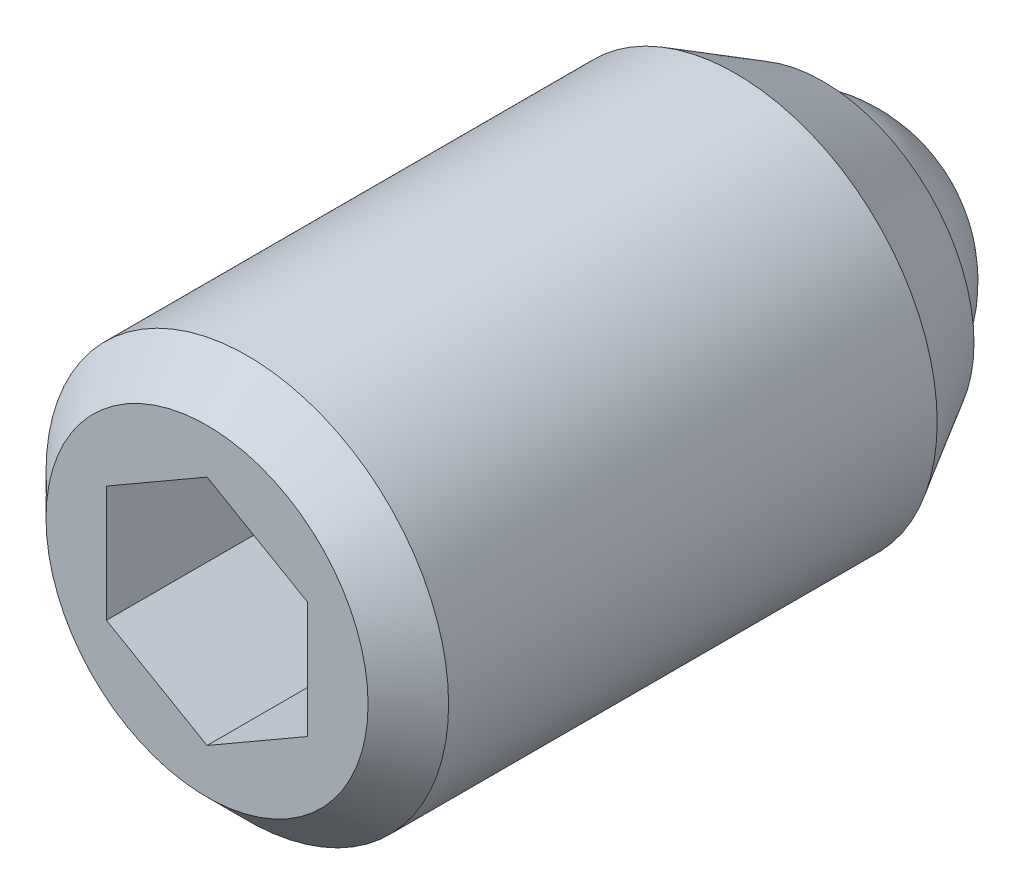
ISO-10303-21;
HEADER;
FILE_DESCRIPTION(('STEP AP214'),'2;1');
FILE_NAME('part.step','',(''),(''),'','','');
FILE_SCHEMA(('AUTOMOTIVE_DESIGN { 1 0 10303 214 1 1 1 1 }'));
ENDSEC;
DATA;
#1=APPLICATION_CONTEXT('core data for automotive mechanical design processes');
#2=APPLICATION_PROTOCOL_DEFINITION('international standard','automotive_design',2000,#1);
#3=PRODUCT_CONTEXT('',#1,'mechanical');
#4=PRODUCT('Part','Part','',(#3));
#5=PRODUCT_RELATED_PRODUCT_CATEGORY('part','',(#4));
#6=PRODUCT_DEFINITION_FORMATION('','',#4);
#7=PRODUCT_DEFINITION_CONTEXT('part definition',#1,'design');
#8=PRODUCT_DEFINITION('design','',#6,#7);
#9=PRODUCT_DEFINITION_SHAPE('','',#8);
#10=(LENGTH_UNIT() NAMED_UNIT(*) SI_UNIT(.MILLI.,.METRE.));
#11=(NAMED_UNIT(*) PLANE_ANGLE_UNIT() SI_UNIT($,.RADIAN.));
#12=(NAMED_UNIT(*) SI_UNIT($,.STERADIAN.) SOLID_ANGLE_UNIT());
#13=UNCERTAINTY_MEASURE_WITH_UNIT(LENGTH_MEASURE(1.E-05),#10,'distance_accuracy_value','');
#14=(GEOMETRIC_REPRESENTATION_CONTEXT(3) GLOBAL_UNCERTAINTY_ASSIGNED_CONTEXT((#13)) GLOBAL_UNIT_ASSIGNED_CONTEXT((#10,
#11,#12)) REPRESENTATION_CONTEXT('',''));
#15=CARTESIAN_POINT('',(0.,0.,0.));
#16=DIRECTION('',(0.,0.,1.));
#17=DIRECTION('',(1.,0.,0.));
#18=AXIS2_PLACEMENT_3D('',#15,#16,#17);
#19=CARTESIAN_POINT('',(2.5,1.44337567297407,15.2));
#20=DIRECTION('',(0.5,0.86602540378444,0.));
#21=DIRECTION('',(0.86602540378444,-0.5,0.));
#22=AXIS2_PLACEMENT_3D('',#19,#20,#21);
#23=PLANE('',#22);
#24=DIRECTION('',(0.,0.,1.));
#25=VECTOR('',#24,1.);
#26=CARTESIAN_POINT('',(2.5,1.44337567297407,15.2));
#27=LINE('',#26,#25);
#28=CARTESIAN_POINT('',(2.5,1.44337567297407,13.7));
#29=VERTEX_POINT('',#28);
#30=CARTESIAN_POINT('',(2.5,1.44337567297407,17.7));
#31=VERTEX_POINT('',#30);
#32=EDGE_CURVE('E68',#29,#31,#27,.T.);
#33=ORIENTED_EDGE('',*,*,#32,.T.);
#34=DIRECTION('',(-0.86602540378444,0.5,0.));
#35=VECTOR('',#34,1.);
#36=CARTESIAN_POINT('',(2.5,1.44337567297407,17.7));
#37=LINE('',#36,#35);
#38=CARTESIAN_POINT('',(0.,2.88675134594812,17.7));
#39=VERTEX_POINT('',#38);
#40=EDGE_CURVE('E29',#31,#39,#37,.T.);
#41=ORIENTED_EDGE('',*,*,#40,.T.);
#42=DIRECTION('',(0.,0.,1.));
#43=VECTOR('',#42,1.);
#44=CARTESIAN_POINT('',(0.,2.88675134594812,15.2));
#45=LINE('',#44,#43);
#46=CARTESIAN_POINT('',(0.,2.88675134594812,13.7));
#47=VERTEX_POINT('',#46);
#48=EDGE_CURVE('E80',#47,#39,#45,.T.);
#49=ORIENTED_EDGE('',*,*,#48,.F.);
#50=DIRECTION('',(-0.86602540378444,0.5,0.));
#51=VECTOR('',#50,1.);
#52=CARTESIAN_POINT('',(2.5,1.44337567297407,13.7));
#53=LINE('',#52,#51);
#54=EDGE_CURVE('E79',#29,#47,#53,.T.);
#55=ORIENTED_EDGE('',*,*,#54,.F.);
#56=EDGE_LOOP('',(#33,#41,#49,#55));
#57=FACE_BOUND('',#56,.T.);
#58=ADVANCED_FACE('F14',(#57),#23,.F.);
#59=CARTESIAN_POINT('',(2.5,-1.44337567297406,15.2));
#60=DIRECTION('',(1.,0.,0.));
#61=DIRECTION('',(0.,-1.,0.));
#62=AXIS2_PLACEMENT_3D('',#59,#60,#61);
#63=PLANE('',#62);
#64=DIRECTION('',(0.,0.,1.));
#65=VECTOR('',#64,1.);
#66=CARTESIAN_POINT('',(2.5,-1.44337567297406,15.2));
#67=LINE('',#66,#65);
#68=CARTESIAN_POINT('',(2.5,-1.44337567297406,13.7));
#69=VERTEX_POINT('',#68);
#70=CARTESIAN_POINT('',(2.5,-1.44337567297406,17.7));
#71=VERTEX_POINT('',#70);
#72=EDGE_CURVE('E76',#69,#71,#67,.T.);
#73=ORIENTED_EDGE('',*,*,#72,.T.);
#74=DIRECTION('',(0.,1.,0.));
#75=VECTOR('',#74,1.);
#76=CARTESIAN_POINT('',(2.5,-1.44337567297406,17.7));
#77=LINE('',#76,#75);
#78=EDGE_CURVE('E75',#71,#31,#77,.T.);
#79=ORIENTED_EDGE('',*,*,#78,.T.);
#80=ORIENTED_EDGE('',*,*,#32,.F.);
#81=DIRECTION('',(0.,1.,0.));
#82=VECTOR('',#81,1.);
#83=CARTESIAN_POINT('',(2.5,-1.44337567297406,13.7));
#84=LINE('',#83,#82);
#85=EDGE_CURVE('E72',#69,#29,#84,.T.);
#86=ORIENTED_EDGE('',*,*,#85,.F.);
#87=EDGE_LOOP('',(#73,#79,#80,#86));
#88=FACE_BOUND('',#87,.T.);
#89=ADVANCED_FACE('F70',(#88),#63,.F.);
#90=CARTESIAN_POINT('',(2.5,-1.44337567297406,15.2));
#91=DIRECTION('',(-0.5,0.866025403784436,0.));
#92=DIRECTION('',(0.866025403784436,0.5,0.));
#93=AXIS2_PLACEMENT_3D('',#90,#91,#92);
#94=PLANE('',#93);
#95=DIRECTION('',(0.,0.,1.));
#96=VECTOR('',#95,1.);
#97=CARTESIAN_POINT('',(0.,-2.88675134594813,15.2));
#98=LINE('',#97,#96);
#99=CARTESIAN_POINT('',(0.,-2.88675134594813,13.7));
#100=VERTEX_POINT('',#99);
#101=CARTESIAN_POINT('',(0.,-2.88675134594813,17.7));
#102=VERTEX_POINT('',#101);
#103=EDGE_CURVE('E122',#100,#102,#98,.T.);
#104=ORIENTED_EDGE('',*,*,#103,.T.);
#105=DIRECTION('',(-0.866025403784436,-0.5,0.));
#106=VECTOR('',#105,1.);
#107=CARTESIAN_POINT('',(2.5,-1.44337567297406,17.7));
#108=LINE('',#107,#106);
#109=EDGE_CURVE('E113',#71,#102,#108,.T.);
#110=ORIENTED_EDGE('',*,*,#109,.F.);
#111=ORIENTED_EDGE('',*,*,#72,.F.);
#112=DIRECTION('',(0.866025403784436,0.5,0.));
#113=VECTOR('',#112,1.);
#114=CARTESIAN_POINT('',(0.,-2.88675134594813,13.7));
#115=LINE('',#114,#113);
#116=EDGE_CURVE('E89',#100,#69,#115,.T.);
#117=ORIENTED_EDGE('',*,*,#116,.F.);
#118=EDGE_LOOP('',(#104,#110,#111,#117));
#119=FACE_BOUND('',#118,.T.);
#120=ADVANCED_FACE('F147',(#119),#94,.T.);
#121=CARTESIAN_POINT('',(-2.5,-1.44337567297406,15.2));
#122=DIRECTION('',(-0.5,-0.866025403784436,0.));
#123=DIRECTION('',(-0.866025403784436,0.5,0.));
#124=AXIS2_PLACEMENT_3D('',#121,#122,#123);
#125=PLANE('',#124);
#126=DIRECTION('',(0.,0.,1.));
#127=VECTOR('',#126,1.);
#128=CARTESIAN_POINT('',(-2.5,-1.44337567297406,15.2));
#129=LINE('',#128,#127);
#130=CARTESIAN_POINT('',(-2.5,-1.44337567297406,13.7));
#131=VERTEX_POINT('',#130);
#132=CARTESIAN_POINT('',(-2.5,-1.44337567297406,17.7));
#133=VERTEX_POINT('',#132);
#134=EDGE_CURVE('E120',#131,#133,#129,.T.);
#135=ORIENTED_EDGE('',*,*,#134,.T.);
#136=DIRECTION('',(0.866025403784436,-0.5,0.));
#137=VECTOR('',#136,1.);
#138=CARTESIAN_POINT('',(-2.5,-1.44337567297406,17.7));
#139=LINE('',#138,#137);
#140=EDGE_CURVE('E111',#133,#102,#139,.T.);
#141=ORIENTED_EDGE('',*,*,#140,.T.);
#142=ORIENTED_EDGE('',*,*,#103,.F.);
#143=DIRECTION('',(0.866025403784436,-0.5,0.));
#144=VECTOR('',#143,1.);
#145=CARTESIAN_POINT('',(-2.5,-1.44337567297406,13.7));
#146=LINE('',#145,#144);
#147=EDGE_CURVE('E101',#131,#100,#146,.T.);
#148=ORIENTED_EDGE('',*,*,#147,.F.);
#149=EDGE_LOOP('',(#135,#141,#142,#148));
#150=FACE_BOUND('',#149,.T.);
#151=ADVANCED_FACE('F157',(#150),#125,.F.);
#152=CARTESIAN_POINT('',(-2.5,-1.44337567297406,15.2));
#153=DIRECTION('',(1.,0.,0.));
#154=DIRECTION('',(0.,-1.,0.));
#155=AXIS2_PLACEMENT_3D('',#152,#153,#154);
#156=PLANE('',#155);
#157=DIRECTION('',(0.,0.,1.));
#158=VECTOR('',#157,1.);
#159=CARTESIAN_POINT('',(-2.5,1.44337567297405,15.2));
#160=LINE('',#159,#158);
#161=CARTESIAN_POINT('',(-2.5,1.44337567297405,13.7));
#162=VERTEX_POINT('',#161);
#163=CARTESIAN_POINT('',(-2.5,1.44337567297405,17.7));
#164=VERTEX_POINT('',#163);
#165=EDGE_CURVE('E37',#162,#164,#160,.T.);
#166=ORIENTED_EDGE('',*,*,#165,.T.);
#167=DIRECTION('',(0.,1.,0.));
#168=VECTOR('',#167,1.);
#169=CARTESIAN_POINT('',(-2.5,-1.44337567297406,17.7));
#170=LINE('',#169,#168);
#171=EDGE_CURVE('E108',#133,#164,#170,.T.);
#172=ORIENTED_EDGE('',*,*,#171,.F.);
#173=ORIENTED_EDGE('',*,*,#134,.F.);
#174=DIRECTION('',(0.,-1.,0.));
#175=VECTOR('',#174,1.);
#176=CARTESIAN_POINT('',(-2.5,1.44337567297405,13.7));
#177=LINE('',#176,#175);
#178=EDGE_CURVE('E98',#162,#131,#177,.T.);
#179=ORIENTED_EDGE('',*,*,#178,.F.);
#180=EDGE_LOOP('',(#166,#172,#173,#179));
#181=FACE_BOUND('',#180,.T.);
#182=ADVANCED_FACE('F153',(#181),#156,.T.);
#183=CARTESIAN_POINT('',(-2.5,1.44337567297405,15.2));
#184=DIRECTION('',(0.5,-0.866025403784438,0.));
#185=DIRECTION('',(-0.866025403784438,-0.5,0.));
#186=AXIS2_PLACEMENT_3D('',#183,#184,#185);
#187=PLANE('',#186);
#188=ORIENTED_EDGE('',*,*,#165,.F.);
#189=DIRECTION('',(-0.866025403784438,-0.5,0.));
#190=VECTOR('',#189,1.);
#191=CARTESIAN_POINT('',(0.,2.88675134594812,13.7));
#192=LINE('',#191,#190);
#193=EDGE_CURVE('E84',#47,#162,#192,.T.);
#194=ORIENTED_EDGE('',*,*,#193,.F.);
#195=ORIENTED_EDGE('',*,*,#48,.T.);
#196=DIRECTION('',(0.866025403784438,0.5,0.));
#197=VECTOR('',#196,1.);
#198=CARTESIAN_POINT('',(-2.5,1.44337567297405,17.7));
#199=LINE('',#198,#197);
#200=EDGE_CURVE('E105',#164,#39,#199,.T.);
#201=ORIENTED_EDGE('',*,*,#200,.F.);
#202=EDGE_LOOP('',(#188,#194,#195,#201));
#203=FACE_BOUND('',#202,.T.);
#204=ADVANCED_FACE('F150',(#203),#187,.T.);
#205=CARTESIAN_POINT('',(0.,0.,17.45));
#206=DIRECTION('',(0.,0.,-1.));
#207=DIRECTION('',(1.,0.,0.));
#208=AXIS2_PLACEMENT_3D('',#205,#206,#207);
#209=CYLINDRICAL_SURFACE('',#208,5.);
#210=CARTESIAN_POINT('',(0.,0.,16.7));
#211=DIRECTION('',(0.,0.,-1.));
#212=DIRECTION('',(1.,0.,0.));
#213=AXIS2_PLACEMENT_3D('',#210,#211,#212);
#214=CIRCLE('',#213,5.);
#215=CARTESIAN_POINT('',(5.,0.,16.7));
#216=VERTEX_POINT('',#215);
#217=EDGE_CURVE('E9',#216,#216,#214,.T.);
#218=ORIENTED_EDGE('',*,*,#217,.T.);
#219=EDGE_LOOP('',(#218));
#220=FACE_BOUND('',#219,.T.);
#221=CARTESIAN_POINT('',(0.,0.,4.56506350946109));
#222=DIRECTION('',(0.,0.,-1.));
#223=DIRECTION('',(-1.,0.,0.));
#224=AXIS2_PLACEMENT_3D('',#221,#222,#223);
#225=CIRCLE('',#224,5.);
#226=CARTESIAN_POINT('',(-5.,0.,4.56506350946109));
#227=VERTEX_POINT('',#226);
#228=EDGE_CURVE('E244',#227,#227,#225,.T.);
#229=ORIENTED_EDGE('',*,*,#228,.F.);
#230=EDGE_LOOP('',(#229));
#231=FACE_BOUND('',#230,.T.);
#232=ADVANCED_FACE('F16',(#220,#231),#209,.T.);
#233=CARTESIAN_POINT('',(0.,0.,16.7));
#234=DIRECTION('',(0.,0.,-1.));
#235=DIRECTION('',(1.,0.,0.));
#236=AXIS2_PLACEMENT_3D('',#233,#234,#235);
#237=CONICAL_SURFACE('',#236,5.,0.785398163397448);
#238=CARTESIAN_POINT('',(0.,0.,17.7));
#239=DIRECTION('',(0.,0.,-1.));
#240=DIRECTION('',(1.,0.,0.));
#241=AXIS2_PLACEMENT_3D('',#238,#239,#240);
#242=CIRCLE('',#241,4.);
#243=CARTESIAN_POINT('',(4.,0.,17.7));
#244=VERTEX_POINT('',#243);
#245=EDGE_CURVE('E22',#244,#244,#242,.T.);
#246=ORIENTED_EDGE('',*,*,#245,.T.);
#247=EDGE_LOOP('',(#246));
#248=FACE_BOUND('',#247,.T.);
#249=ORIENTED_EDGE('',*,*,#217,.F.);
#250=EDGE_LOOP('',(#249));
#251=FACE_BOUND('',#250,.T.);
#252=ADVANCED_FACE('F127',(#248,#251),#237,.T.);
#253=CARTESIAN_POINT('',(0.,0.,17.7));
#254=DIRECTION('',(0.,0.,-1.));
#255=DIRECTION('',(1.,0.,0.));
#256=AXIS2_PLACEMENT_3D('',#253,#254,#255);
#257=PLANE('',#256);
#258=ORIENTED_EDGE('',*,*,#200,.T.);
#259=ORIENTED_EDGE('',*,*,#40,.F.);
#260=ORIENTED_EDGE('',*,*,#78,.F.);
#261=ORIENTED_EDGE('',*,*,#109,.T.);
#262=ORIENTED_EDGE('',*,*,#140,.F.);
#263=ORIENTED_EDGE('',*,*,#171,.T.);
#264=EDGE_LOOP('',(#258,#259,#260,#261,#262,#263));
#265=FACE_BOUND('',#264,.T.);
#266=ORIENTED_EDGE('',*,*,#245,.F.);
#267=EDGE_LOOP('',(#266));
#268=FACE_BOUND('',#267,.T.);
#269=ADVANCED_FACE('F130',(#265,#268),#257,.F.);
#270=CARTESIAN_POINT('',(2.5,1.44337567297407,13.7));
#271=DIRECTION('',(0.,0.,1.));
#272=DIRECTION('',(1.,0.,0.));
#273=AXIS2_PLACEMENT_3D('',#270,#271,#272);
#274=PLANE('',#273);
#275=ORIENTED_EDGE('',*,*,#85,.T.);
#276=ORIENTED_EDGE('',*,*,#54,.T.);
#277=ORIENTED_EDGE('',*,*,#193,.T.);
#278=ORIENTED_EDGE('',*,*,#178,.T.);
#279=ORIENTED_EDGE('',*,*,#147,.T.);
#280=ORIENTED_EDGE('',*,*,#116,.T.);
#281=EDGE_LOOP('',(#275,#276,#277,#278,#279,#280));
#282=FACE_BOUND('',#281,.T.);
#283=ADVANCED_FACE('F86',(#282),#274,.T.);
#284=CARTESIAN_POINT('',(0.,0.,3.5));
#285=DIRECTION('',(0.,0.,-1.));
#286=DIRECTION('',(-1.,0.,0.));
#287=AXIS2_PLACEMENT_3D('',#284,#285,#286);
#288=SPHERICAL_SURFACE('',#287,3.5);
#289=CARTESIAN_POINT('',(0.,0.,2.4));
#290=DIRECTION('',(0.,0.,-1.));
#291=DIRECTION('',(-1.,0.,0.));
#292=AXIS2_PLACEMENT_3D('',#289,#290,#291);
#293=CIRCLE('',#292,3.32264954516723);
#294=CARTESIAN_POINT('',(-3.32264954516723,0.,2.4));
#295=VERTEX_POINT('',#294);
#296=EDGE_CURVE('E90',#295,#295,#293,.T.);
#297=ORIENTED_EDGE('',*,*,#296,.T.);
#298=EDGE_LOOP('',(#297));
#299=FACE_BOUND('',#298,.T.);
#300=ADVANCED_FACE('F139',(#299),#288,.T.);
#301=CARTESIAN_POINT('',(-3.32264954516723,0.,2.4));
#302=DIRECTION('',(0.,0.,-1.));
#303=DIRECTION('',(-1.,0.,0.));
#304=AXIS2_PLACEMENT_3D('',#301,#302,#303);
#305=PLANE('',#304);
#306=CARTESIAN_POINT('',(0.,0.,2.4));
#307=DIRECTION('',(0.,0.,-1.));
#308=DIRECTION('',(-1.,0.,0.));
#309=AXIS2_PLACEMENT_3D('',#306,#307,#308);
#310=CIRCLE('',#309,3.75);
#311=CARTESIAN_POINT('',(-3.75,0.,2.4));
#312=VERTEX_POINT('',#311);
#313=EDGE_CURVE('E93',#312,#312,#310,.T.);
#314=ORIENTED_EDGE('',*,*,#313,.T.);
#315=EDGE_LOOP('',(#314));
#316=FACE_BOUND('',#315,.T.);
#317=ORIENTED_EDGE('',*,*,#296,.F.);
#318=EDGE_LOOP('',(#317));
#319=FACE_BOUND('',#318,.T.);
#320=ADVANCED_FACE('F216',(#316,#319),#305,.T.);
#321=CARTESIAN_POINT('',(0.,0.,2.4));
#322=DIRECTION('',(0.,0.,1.));
#323=DIRECTION('',(1.,0.,0.));
#324=AXIS2_PLACEMENT_3D('',#321,#322,#323);
#325=CONICAL_SURFACE('',#324,3.75,0.523598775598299);
#326=ORIENTED_EDGE('',*,*,#228,.T.);
#327=EDGE_LOOP('',(#326));
#328=FACE_BOUND('',#327,.T.);
#329=ORIENTED_EDGE('',*,*,#313,.F.);
#330=EDGE_LOOP('',(#329));
#331=FACE_BOUND('',#330,.T.);
#332=ADVANCED_FACE('F225',(#328,#331),#325,.T.);
#333=CLOSED_SHELL('',(#58,#89,#120,#151,#182,#204,#232,#252,#269,#283,#300,#320,#332));
#334=MANIFOLD_SOLID_BREP('B1',#333);
#335=ADVANCED_BREP_SHAPE_REPRESENTATION('',(#18,#334),#14);
#336=SHAPE_DEFINITION_REPRESENTATION(#9,#335);
ENDSEC;
END-ISO-10303-21;
